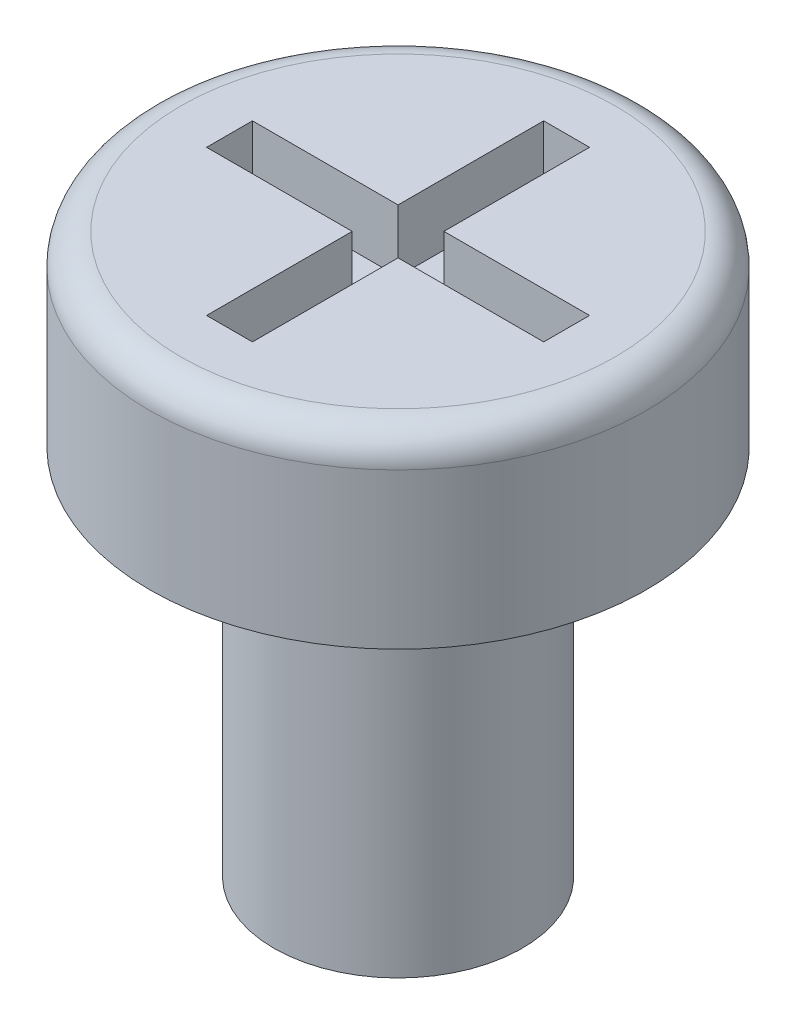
ISO-10303-21;
HEADER;
FILE_DESCRIPTION(('STEP AP214'),'2;1');
FILE_NAME('part.step','',(''),(''),'','','');
FILE_SCHEMA(('AUTOMOTIVE_DESIGN { 1 0 10303 214 1 1 1 1 }'));
ENDSEC;
DATA;
#1=APPLICATION_CONTEXT('core data for automotive mechanical design processes');
#2=APPLICATION_PROTOCOL_DEFINITION('international standard','automotive_design',2000,#1);
#3=PRODUCT_CONTEXT('',#1,'mechanical');
#4=PRODUCT('Part','Part','',(#3));
#5=PRODUCT_RELATED_PRODUCT_CATEGORY('part','',(#4));
#6=PRODUCT_DEFINITION_FORMATION('','',#4);
#7=PRODUCT_DEFINITION_CONTEXT('part definition',#1,'design');
#8=PRODUCT_DEFINITION('design','',#6,#7);
#9=PRODUCT_DEFINITION_SHAPE('','',#8);
#10=(LENGTH_UNIT() NAMED_UNIT(*) SI_UNIT(.MILLI.,.METRE.));
#11=(NAMED_UNIT(*) PLANE_ANGLE_UNIT() SI_UNIT($,.RADIAN.));
#12=(NAMED_UNIT(*) SI_UNIT($,.STERADIAN.) SOLID_ANGLE_UNIT());
#13=UNCERTAINTY_MEASURE_WITH_UNIT(LENGTH_MEASURE(1.E-05),#10,'distance_accuracy_value','');
#14=(GEOMETRIC_REPRESENTATION_CONTEXT(3) GLOBAL_UNCERTAINTY_ASSIGNED_CONTEXT((#13)) GLOBAL_UNIT_ASSIGNED_CONTEXT((#10,
#11,#12)) REPRESENTATION_CONTEXT('',''));
#15=CARTESIAN_POINT('',(0.,0.,0.));
#16=DIRECTION('',(0.,0.,1.));
#17=DIRECTION('',(1.,0.,0.));
#18=AXIS2_PLACEMENT_3D('',#15,#16,#17);
#19=CARTESIAN_POINT('',(0.,3.,0.));
#20=DIRECTION('',(0.,-1.,0.));
#21=DIRECTION('',(0.,0.,-1.));
#22=AXIS2_PLACEMENT_3D('',#19,#20,#21);
#23=CYLINDRICAL_SURFACE('',#22,0.999999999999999);
#24=CARTESIAN_POINT('',(0.,3.,0.));
#25=DIRECTION('',(0.,1.,0.));
#26=DIRECTION('',(0.,0.,1.));
#27=AXIS2_PLACEMENT_3D('',#24,#25,#26);
#28=CIRCLE('',#27,0.999999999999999);
#29=CARTESIAN_POINT('',(0.,3.,0.999999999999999));
#30=VERTEX_POINT('',#29);
#31=EDGE_CURVE('E209',#30,#30,#28,.T.);
#32=ORIENTED_EDGE('',*,*,#31,.F.);
#33=EDGE_LOOP('',(#32));
#34=FACE_BOUND('',#33,.T.);
#35=CARTESIAN_POINT('',(0.,0.,0.));
#36=DIRECTION('',(0.,1.,0.));
#37=DIRECTION('',(0.,0.,1.));
#38=AXIS2_PLACEMENT_3D('',#35,#36,#37);
#39=CIRCLE('',#38,0.999999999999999);
#40=CARTESIAN_POINT('',(0.,0.,0.999999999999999));
#41=VERTEX_POINT('',#40);
#42=EDGE_CURVE('E208',#41,#41,#39,.T.);
#43=ORIENTED_EDGE('',*,*,#42,.T.);
#44=EDGE_LOOP('',(#43));
#45=FACE_BOUND('',#44,.T.);
#46=ADVANCED_FACE('F32',(#34,#45),#23,.T.);
#47=CARTESIAN_POINT('',(0.,0.,0.));
#48=DIRECTION('',(0.,1.,0.));
#49=DIRECTION('',(0.,0.,1.));
#50=AXIS2_PLACEMENT_3D('',#47,#48,#49);
#51=PLANE('',#50);
#52=ORIENTED_EDGE('',*,*,#42,.F.);
#53=EDGE_LOOP('',(#52));
#54=FACE_BOUND('',#53,.T.);
#55=ADVANCED_FACE('F232',(#54),#51,.F.);
#56=CARTESIAN_POINT('',(0.,3.,0.));
#57=DIRECTION('',(0.,1.,0.));
#58=DIRECTION('',(0.,0.,1.));
#59=AXIS2_PLACEMENT_3D('',#56,#57,#58);
#60=PLANE('',#59);
#61=CARTESIAN_POINT('',(0.,3.,0.));
#62=DIRECTION('',(0.,1.,0.));
#63=DIRECTION('',(0.,0.,1.));
#64=AXIS2_PLACEMENT_3D('',#61,#62,#63);
#65=CIRCLE('',#64,2.);
#66=CARTESIAN_POINT('',(0.,3.,2.));
#67=VERTEX_POINT('',#66);
#68=EDGE_CURVE('E188',#67,#67,#65,.T.);
#69=ORIENTED_EDGE('',*,*,#68,.F.);
#70=EDGE_LOOP('',(#69));
#71=FACE_BOUND('',#70,.T.);
#72=ORIENTED_EDGE('',*,*,#31,.T.);
#73=EDGE_LOOP('',(#72));
#74=FACE_BOUND('',#73,.T.);
#75=ADVANCED_FACE('F237',(#71,#74),#60,.F.);
#76=CARTESIAN_POINT('',(0.,4.5,0.));
#77=DIRECTION('',(0.,-1.,0.));
#78=DIRECTION('',(0.,0.,-1.));
#79=AXIS2_PLACEMENT_3D('',#76,#77,#78);
#80=CYLINDRICAL_SURFACE('',#79,2.);
#81=CARTESIAN_POINT('',(0.,4.25,0.));
#82=DIRECTION('',(0.,1.,0.));
#83=DIRECTION('',(0.,0.,1.));
#84=AXIS2_PLACEMENT_3D('',#81,#82,#83);
#85=CIRCLE('',#84,2.);
#86=CARTESIAN_POINT('',(0.,4.25,2.));
#87=VERTEX_POINT('',#86);
#88=EDGE_CURVE('E11',#87,#87,#85,.F.);
#89=ORIENTED_EDGE('',*,*,#88,.T.);
#90=EDGE_LOOP('',(#89));
#91=FACE_BOUND('',#90,.T.);
#92=ORIENTED_EDGE('',*,*,#68,.T.);
#93=EDGE_LOOP('',(#92));
#94=FACE_BOUND('',#93,.T.);
#95=ADVANCED_FACE('F227',(#91,#94),#80,.T.);
#96=CARTESIAN_POINT('',(0.,4.5,0.));
#97=DIRECTION('',(0.,1.,0.));
#98=DIRECTION('',(0.,0.,1.));
#99=AXIS2_PLACEMENT_3D('',#96,#97,#98);
#100=PLANE('',#99);
#101=DIRECTION('',(0.,0.,-1.));
#102=VECTOR('',#101,1.);
#103=CARTESIAN_POINT('',(0.184631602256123,4.5,-0.184631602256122));
#104=LINE('',#103,#102);
#105=CARTESIAN_POINT('',(0.184631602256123,4.5,-0.184631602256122));
#106=VERTEX_POINT('',#105);
#107=CARTESIAN_POINT('',(0.184631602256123,4.5,-1.35729177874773));
#108=VERTEX_POINT('',#107);
#109=EDGE_CURVE('E47',#106,#108,#104,.T.);
#110=ORIENTED_EDGE('',*,*,#109,.F.);
#111=DIRECTION('',(-1.,0.,0.));
#112=VECTOR('',#111,1.);
#113=CARTESIAN_POINT('',(0.184631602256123,4.5,-0.184631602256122));
#114=LINE('',#113,#112);
#115=CARTESIAN_POINT('',(1.35729177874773,4.5,-0.184631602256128));
#116=VERTEX_POINT('',#115);
#117=EDGE_CURVE('E184',#116,#106,#114,.T.);
#118=ORIENTED_EDGE('',*,*,#117,.F.);
#119=DIRECTION('',(0.,0.,-1.));
#120=VECTOR('',#119,1.);
#121=CARTESIAN_POINT('',(1.35729177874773,4.5,0.184631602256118));
#122=LINE('',#121,#120);
#123=CARTESIAN_POINT('',(1.35729177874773,4.5,0.184631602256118));
#124=VERTEX_POINT('',#123);
#125=EDGE_CURVE('E182',#124,#116,#122,.T.);
#126=ORIENTED_EDGE('',*,*,#125,.F.);
#127=DIRECTION('',(1.,0.,0.));
#128=VECTOR('',#127,1.);
#129=CARTESIAN_POINT('',(0.184631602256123,4.5,0.184631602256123));
#130=LINE('',#129,#128);
#131=CARTESIAN_POINT('',(0.184631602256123,4.5,0.184631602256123));
#132=VERTEX_POINT('',#131);
#133=EDGE_CURVE('E131',#132,#124,#130,.T.);
#134=ORIENTED_EDGE('',*,*,#133,.F.);
#135=DIRECTION('',(0.,0.,-1.));
#136=VECTOR('',#135,1.);
#137=CARTESIAN_POINT('',(0.184631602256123,4.5,1.35729177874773));
#138=LINE('',#137,#136);
#139=CARTESIAN_POINT('',(0.184631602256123,4.5,1.35729177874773));
#140=VERTEX_POINT('',#139);
#141=EDGE_CURVE('E178',#140,#132,#138,.T.);
#142=ORIENTED_EDGE('',*,*,#141,.F.);
#143=DIRECTION('',(1.,0.,0.));
#144=VECTOR('',#143,1.);
#145=CARTESIAN_POINT('',(-0.184631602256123,4.5,1.35729177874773));
#146=LINE('',#145,#144);
#147=CARTESIAN_POINT('',(-0.184631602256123,4.5,1.35729177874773));
#148=VERTEX_POINT('',#147);
#149=EDGE_CURVE('E175',#148,#140,#146,.T.);
#150=ORIENTED_EDGE('',*,*,#149,.F.);
#151=DIRECTION('',(0.,0.,1.));
#152=VECTOR('',#151,1.);
#153=CARTESIAN_POINT('',(-0.184631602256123,4.5,1.35729177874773));
#154=LINE('',#153,#152);
#155=CARTESIAN_POINT('',(-0.184631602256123,4.5,0.184631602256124));
#156=VERTEX_POINT('',#155);
#157=EDGE_CURVE('E172',#156,#148,#154,.T.);
#158=ORIENTED_EDGE('',*,*,#157,.F.);
#159=DIRECTION('',(1.,0.,0.));
#160=VECTOR('',#159,1.);
#161=CARTESIAN_POINT('',(-1.35729177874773,4.5,0.184631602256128));
#162=LINE('',#161,#160);
#163=CARTESIAN_POINT('',(-1.35729177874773,4.5,0.184631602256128));
#164=VERTEX_POINT('',#163);
#165=EDGE_CURVE('E169',#164,#156,#162,.T.);
#166=ORIENTED_EDGE('',*,*,#165,.F.);
#167=DIRECTION('',(0.,0.,1.));
#168=VECTOR('',#167,1.);
#169=CARTESIAN_POINT('',(-1.35729177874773,4.5,0.184631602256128));
#170=LINE('',#169,#168);
#171=CARTESIAN_POINT('',(-1.35729177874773,4.5,-0.184631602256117));
#172=VERTEX_POINT('',#171);
#173=EDGE_CURVE('E166',#172,#164,#170,.T.);
#174=ORIENTED_EDGE('',*,*,#173,.F.);
#175=DIRECTION('',(-1.,0.,0.));
#176=VECTOR('',#175,1.);
#177=CARTESIAN_POINT('',(-1.35729177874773,4.5,-0.184631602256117));
#178=LINE('',#177,#176);
#179=CARTESIAN_POINT('',(-0.184631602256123,4.5,-0.184631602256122));
#180=VERTEX_POINT('',#179);
#181=EDGE_CURVE('E163',#180,#172,#178,.T.);
#182=ORIENTED_EDGE('',*,*,#181,.F.);
#183=DIRECTION('',(0.,0.,1.));
#184=VECTOR('',#183,1.);
#185=CARTESIAN_POINT('',(-0.184631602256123,4.5,-0.184631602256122));
#186=LINE('',#185,#184);
#187=CARTESIAN_POINT('',(-0.184631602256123,4.5,-1.35729177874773));
#188=VERTEX_POINT('',#187);
#189=EDGE_CURVE('E160',#188,#180,#186,.T.);
#190=ORIENTED_EDGE('',*,*,#189,.F.);
#191=DIRECTION('',(-1.,0.,0.));
#192=VECTOR('',#191,1.);
#193=CARTESIAN_POINT('',(-0.184631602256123,4.5,-1.35729177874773));
#194=LINE('',#193,#192);
#195=EDGE_CURVE('E157',#108,#188,#194,.T.);
#196=ORIENTED_EDGE('',*,*,#195,.F.);
#197=EDGE_LOOP('',(#110,#118,#126,#134,#142,#150,#158,#166,#174,#182,#190,#196));
#198=FACE_BOUND('',#197,.T.);
#199=CARTESIAN_POINT('',(0.,4.5,0.));
#200=DIRECTION('',(0.,1.,0.));
#201=DIRECTION('',(0.,0.,1.));
#202=AXIS2_PLACEMENT_3D('',#199,#200,#201);
#203=CIRCLE('',#202,1.75);
#204=CARTESIAN_POINT('',(0.,4.5,1.75));
#205=VERTEX_POINT('',#204);
#206=EDGE_CURVE('E40',#205,#205,#203,.T.);
#207=ORIENTED_EDGE('',*,*,#206,.T.);
#208=EDGE_LOOP('',(#207));
#209=FACE_BOUND('',#208,.T.);
#210=ADVANCED_FACE('F216',(#198,#209),#100,.T.);
#211=CARTESIAN_POINT('',(0.,4.25,0.));
#212=DIRECTION('',(0.,1.,0.));
#213=DIRECTION('',(0.,0.,1.));
#214=AXIS2_PLACEMENT_3D('',#211,#212,#213);
#215=TOROIDAL_SURFACE('',#214,1.75,0.25);
#216=ORIENTED_EDGE('',*,*,#88,.F.);
#217=EDGE_LOOP('',(#216));
#218=FACE_BOUND('',#217,.T.);
#219=ORIENTED_EDGE('',*,*,#206,.F.);
#220=EDGE_LOOP('',(#219));
#221=FACE_BOUND('',#220,.T.);
#222=ADVANCED_FACE('F34',(#218,#221),#215,.T.);
#223=CARTESIAN_POINT('',(0.184631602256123,4.,-0.184631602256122));
#224=DIRECTION('',(1.,0.,0.));
#225=DIRECTION('',(0.,0.,-1.));
#226=AXIS2_PLACEMENT_3D('',#223,#224,#225);
#227=PLANE('',#226);
#228=ORIENTED_EDGE('',*,*,#109,.T.);
#229=DIRECTION('',(0.,1.,0.));
#230=VECTOR('',#229,1.);
#231=CARTESIAN_POINT('',(0.184631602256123,4.,-1.35729177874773));
#232=LINE('',#231,#230);
#233=CARTESIAN_POINT('',(0.184631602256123,4.,-1.35729177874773));
#234=VERTEX_POINT('',#233);
#235=EDGE_CURVE('E95',#234,#108,#232,.T.);
#236=ORIENTED_EDGE('',*,*,#235,.F.);
#237=DIRECTION('',(0.,0.,-1.));
#238=VECTOR('',#237,1.);
#239=CARTESIAN_POINT('',(0.184631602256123,4.,-0.184631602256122));
#240=LINE('',#239,#238);
#241=CARTESIAN_POINT('',(0.184631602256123,4.,-0.184631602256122));
#242=VERTEX_POINT('',#241);
#243=EDGE_CURVE('E186',#242,#234,#240,.T.);
#244=ORIENTED_EDGE('',*,*,#243,.F.);
#245=DIRECTION('',(0.,1.,0.));
#246=VECTOR('',#245,1.);
#247=CARTESIAN_POINT('',(0.184631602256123,4.,-0.184631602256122));
#248=LINE('',#247,#246);
#249=EDGE_CURVE('E55',#242,#106,#248,.T.);
#250=ORIENTED_EDGE('',*,*,#249,.T.);
#251=EDGE_LOOP('',(#228,#236,#244,#250));
#252=FACE_BOUND('',#251,.T.);
#253=ADVANCED_FACE('F219',(#252),#227,.F.);
#254=CARTESIAN_POINT('',(0.184631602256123,4.,-0.184631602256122));
#255=DIRECTION('',(0.,0.,-1.));
#256=DIRECTION('',(-1.,0.,0.));
#257=AXIS2_PLACEMENT_3D('',#254,#255,#256);
#258=PLANE('',#257);
#259=ORIENTED_EDGE('',*,*,#117,.T.);
#260=ORIENTED_EDGE('',*,*,#249,.F.);
#261=DIRECTION('',(-1.,0.,0.));
#262=VECTOR('',#261,1.);
#263=CARTESIAN_POINT('',(0.184631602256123,4.,-0.184631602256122));
#264=LINE('',#263,#262);
#265=CARTESIAN_POINT('',(1.35729177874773,4.,-0.184631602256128));
#266=VERTEX_POINT('',#265);
#267=EDGE_CURVE('E143',#266,#242,#264,.T.);
#268=ORIENTED_EDGE('',*,*,#267,.F.);
#269=DIRECTION('',(0.,1.,0.));
#270=VECTOR('',#269,1.);
#271=CARTESIAN_POINT('',(1.35729177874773,4.,-0.184631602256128));
#272=LINE('',#271,#270);
#273=EDGE_CURVE('E135',#266,#116,#272,.T.);
#274=ORIENTED_EDGE('',*,*,#273,.T.);
#275=EDGE_LOOP('',(#259,#260,#268,#274));
#276=FACE_BOUND('',#275,.T.);
#277=ADVANCED_FACE('F225',(#276),#258,.F.);
#278=CARTESIAN_POINT('',(1.35729177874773,4.,0.184631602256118));
#279=DIRECTION('',(1.,0.,0.));
#280=DIRECTION('',(0.,0.,-1.));
#281=AXIS2_PLACEMENT_3D('',#278,#279,#280);
#282=PLANE('',#281);
#283=ORIENTED_EDGE('',*,*,#125,.T.);
#284=ORIENTED_EDGE('',*,*,#273,.F.);
#285=DIRECTION('',(0.,0.,-1.));
#286=VECTOR('',#285,1.);
#287=CARTESIAN_POINT('',(1.35729177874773,4.,0.184631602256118));
#288=LINE('',#287,#286);
#289=CARTESIAN_POINT('',(1.35729177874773,4.,0.184631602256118));
#290=VERTEX_POINT('',#289);
#291=EDGE_CURVE('E139',#290,#266,#288,.T.);
#292=ORIENTED_EDGE('',*,*,#291,.F.);
#293=DIRECTION('',(0.,1.,0.));
#294=VECTOR('',#293,1.);
#295=CARTESIAN_POINT('',(1.35729177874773,4.,0.184631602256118));
#296=LINE('',#295,#294);
#297=EDGE_CURVE('E124',#290,#124,#296,.T.);
#298=ORIENTED_EDGE('',*,*,#297,.T.);
#299=EDGE_LOOP('',(#283,#284,#292,#298));
#300=FACE_BOUND('',#299,.T.);
#301=ADVANCED_FACE('F140',(#300),#282,.F.);
#302=CARTESIAN_POINT('',(0.184631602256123,4.,0.184631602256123));
#303=DIRECTION('',(0.,0.,1.));
#304=DIRECTION('',(1.,0.,0.));
#305=AXIS2_PLACEMENT_3D('',#302,#303,#304);
#306=PLANE('',#305);
#307=ORIENTED_EDGE('',*,*,#133,.T.);
#308=ORIENTED_EDGE('',*,*,#297,.F.);
#309=DIRECTION('',(1.,0.,0.));
#310=VECTOR('',#309,1.);
#311=CARTESIAN_POINT('',(0.184631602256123,4.,0.184631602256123));
#312=LINE('',#311,#310);
#313=CARTESIAN_POINT('',(0.184631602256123,4.,0.184631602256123));
#314=VERTEX_POINT('',#313);
#315=EDGE_CURVE('E128',#314,#290,#312,.T.);
#316=ORIENTED_EDGE('',*,*,#315,.F.);
#317=DIRECTION('',(0.,1.,0.));
#318=VECTOR('',#317,1.);
#319=CARTESIAN_POINT('',(0.184631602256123,4.,0.184631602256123));
#320=LINE('',#319,#318);
#321=EDGE_CURVE('E136',#314,#132,#320,.T.);
#322=ORIENTED_EDGE('',*,*,#321,.T.);
#323=EDGE_LOOP('',(#307,#308,#316,#322));
#324=FACE_BOUND('',#323,.T.);
#325=ADVANCED_FACE('F126',(#324),#306,.F.);
#326=CARTESIAN_POINT('',(0.184631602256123,4.,1.35729177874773));
#327=DIRECTION('',(1.,0.,0.));
#328=DIRECTION('',(0.,0.,-1.));
#329=AXIS2_PLACEMENT_3D('',#326,#327,#328);
#330=PLANE('',#329);
#331=ORIENTED_EDGE('',*,*,#141,.T.);
#332=ORIENTED_EDGE('',*,*,#321,.F.);
#333=DIRECTION('',(0.,0.,-1.));
#334=VECTOR('',#333,1.);
#335=CARTESIAN_POINT('',(0.184631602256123,4.,1.35729177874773));
#336=LINE('',#335,#334);
#337=CARTESIAN_POINT('',(0.184631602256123,4.,1.35729177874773));
#338=VERTEX_POINT('',#337);
#339=EDGE_CURVE('E149',#338,#314,#336,.T.);
#340=ORIENTED_EDGE('',*,*,#339,.F.);
#341=DIRECTION('',(0.,1.,0.));
#342=VECTOR('',#341,1.);
#343=CARTESIAN_POINT('',(0.184631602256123,4.,1.35729177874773));
#344=LINE('',#343,#342);
#345=EDGE_CURVE('E191',#338,#140,#344,.T.);
#346=ORIENTED_EDGE('',*,*,#345,.T.);
#347=EDGE_LOOP('',(#331,#332,#340,#346));
#348=FACE_BOUND('',#347,.T.);
#349=ADVANCED_FACE('F276',(#348),#330,.F.);
#350=CARTESIAN_POINT('',(-0.184631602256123,4.,1.35729177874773));
#351=DIRECTION('',(0.,0.,1.));
#352=DIRECTION('',(1.,0.,0.));
#353=AXIS2_PLACEMENT_3D('',#350,#351,#352);
#354=PLANE('',#353);
#355=ORIENTED_EDGE('',*,*,#149,.T.);
#356=ORIENTED_EDGE('',*,*,#345,.F.);
#357=DIRECTION('',(1.,0.,0.));
#358=VECTOR('',#357,1.);
#359=CARTESIAN_POINT('',(-0.184631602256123,4.,1.35729177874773));
#360=LINE('',#359,#358);
#361=CARTESIAN_POINT('',(-0.184631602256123,4.,1.35729177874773));
#362=VERTEX_POINT('',#361);
#363=EDGE_CURVE('E151',#362,#338,#360,.T.);
#364=ORIENTED_EDGE('',*,*,#363,.F.);
#365=DIRECTION('',(0.,1.,0.));
#366=VECTOR('',#365,1.);
#367=CARTESIAN_POINT('',(-0.184631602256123,4.,1.35729177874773));
#368=LINE('',#367,#366);
#369=EDGE_CURVE('E193',#362,#148,#368,.T.);
#370=ORIENTED_EDGE('',*,*,#369,.T.);
#371=EDGE_LOOP('',(#355,#356,#364,#370));
#372=FACE_BOUND('',#371,.T.);
#373=ADVANCED_FACE('F272',(#372),#354,.F.);
#374=CARTESIAN_POINT('',(-0.184631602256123,4.,1.35729177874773));
#375=DIRECTION('',(-1.,0.,0.));
#376=DIRECTION('',(0.,0.,1.));
#377=AXIS2_PLACEMENT_3D('',#374,#375,#376);
#378=PLANE('',#377);
#379=ORIENTED_EDGE('',*,*,#157,.T.);
#380=ORIENTED_EDGE('',*,*,#369,.F.);
#381=DIRECTION('',(0.,0.,1.));
#382=VECTOR('',#381,1.);
#383=CARTESIAN_POINT('',(-0.184631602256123,4.,1.35729177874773));
#384=LINE('',#383,#382);
#385=CARTESIAN_POINT('',(-0.184631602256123,4.,0.184631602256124));
#386=VERTEX_POINT('',#385);
#387=EDGE_CURVE('E420',#386,#362,#384,.T.);
#388=ORIENTED_EDGE('',*,*,#387,.F.);
#389=DIRECTION('',(0.,1.,0.));
#390=VECTOR('',#389,1.);
#391=CARTESIAN_POINT('',(-0.184631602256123,4.,0.184631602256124));
#392=LINE('',#391,#390);
#393=EDGE_CURVE('E195',#386,#156,#392,.T.);
#394=ORIENTED_EDGE('',*,*,#393,.T.);
#395=EDGE_LOOP('',(#379,#380,#388,#394));
#396=FACE_BOUND('',#395,.T.);
#397=ADVANCED_FACE('F268',(#396),#378,.F.);
#398=CARTESIAN_POINT('',(-1.35729177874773,4.,0.184631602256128));
#399=DIRECTION('',(0.,0.,1.));
#400=DIRECTION('',(1.,0.,0.));
#401=AXIS2_PLACEMENT_3D('',#398,#399,#400);
#402=PLANE('',#401);
#403=ORIENTED_EDGE('',*,*,#165,.T.);
#404=ORIENTED_EDGE('',*,*,#393,.F.);
#405=DIRECTION('',(1.,0.,0.));
#406=VECTOR('',#405,1.);
#407=CARTESIAN_POINT('',(-1.35729177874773,4.,0.184631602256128));
#408=LINE('',#407,#406);
#409=CARTESIAN_POINT('',(-1.35729177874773,4.,0.184631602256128));
#410=VERTEX_POINT('',#409);
#411=EDGE_CURVE('E417',#410,#386,#408,.T.);
#412=ORIENTED_EDGE('',*,*,#411,.F.);
#413=DIRECTION('',(0.,1.,0.));
#414=VECTOR('',#413,1.);
#415=CARTESIAN_POINT('',(-1.35729177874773,4.,0.184631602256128));
#416=LINE('',#415,#414);
#417=EDGE_CURVE('E197',#410,#164,#416,.T.);
#418=ORIENTED_EDGE('',*,*,#417,.T.);
#419=EDGE_LOOP('',(#403,#404,#412,#418));
#420=FACE_BOUND('',#419,.T.);
#421=ADVANCED_FACE('F264',(#420),#402,.F.);
#422=CARTESIAN_POINT('',(-1.35729177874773,4.,0.184631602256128));
#423=DIRECTION('',(-1.,0.,0.));
#424=DIRECTION('',(0.,0.,1.));
#425=AXIS2_PLACEMENT_3D('',#422,#423,#424);
#426=PLANE('',#425);
#427=ORIENTED_EDGE('',*,*,#173,.T.);
#428=ORIENTED_EDGE('',*,*,#417,.F.);
#429=DIRECTION('',(0.,0.,1.));
#430=VECTOR('',#429,1.);
#431=CARTESIAN_POINT('',(-1.35729177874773,4.,0.184631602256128));
#432=LINE('',#431,#430);
#433=CARTESIAN_POINT('',(-1.35729177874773,4.,-0.184631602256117));
#434=VERTEX_POINT('',#433);
#435=EDGE_CURVE('E414',#434,#410,#432,.T.);
#436=ORIENTED_EDGE('',*,*,#435,.F.);
#437=DIRECTION('',(0.,1.,0.));
#438=VECTOR('',#437,1.);
#439=CARTESIAN_POINT('',(-1.35729177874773,4.,-0.184631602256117));
#440=LINE('',#439,#438);
#441=EDGE_CURVE('E199',#434,#172,#440,.T.);
#442=ORIENTED_EDGE('',*,*,#441,.T.);
#443=EDGE_LOOP('',(#427,#428,#436,#442));
#444=FACE_BOUND('',#443,.T.);
#445=ADVANCED_FACE('F260',(#444),#426,.F.);
#446=CARTESIAN_POINT('',(-1.35729177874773,4.,-0.184631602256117));
#447=DIRECTION('',(0.,0.,-1.));
#448=DIRECTION('',(-1.,0.,0.));
#449=AXIS2_PLACEMENT_3D('',#446,#447,#448);
#450=PLANE('',#449);
#451=ORIENTED_EDGE('',*,*,#181,.T.);
#452=ORIENTED_EDGE('',*,*,#441,.F.);
#453=DIRECTION('',(-1.,0.,0.));
#454=VECTOR('',#453,1.);
#455=CARTESIAN_POINT('',(-1.35729177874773,4.,-0.184631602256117));
#456=LINE('',#455,#454);
#457=CARTESIAN_POINT('',(-0.184631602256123,4.,-0.184631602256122));
#458=VERTEX_POINT('',#457);
#459=EDGE_CURVE('E411',#458,#434,#456,.T.);
#460=ORIENTED_EDGE('',*,*,#459,.F.);
#461=DIRECTION('',(0.,1.,0.));
#462=VECTOR('',#461,1.);
#463=CARTESIAN_POINT('',(-0.184631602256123,4.,-0.184631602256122));
#464=LINE('',#463,#462);
#465=EDGE_CURVE('E201',#458,#180,#464,.T.);
#466=ORIENTED_EDGE('',*,*,#465,.T.);
#467=EDGE_LOOP('',(#451,#452,#460,#466));
#468=FACE_BOUND('',#467,.T.);
#469=ADVANCED_FACE('F256',(#468),#450,.F.);
#470=CARTESIAN_POINT('',(-0.184631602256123,4.,-0.184631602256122));
#471=DIRECTION('',(-1.,0.,0.));
#472=DIRECTION('',(0.,0.,1.));
#473=AXIS2_PLACEMENT_3D('',#470,#471,#472);
#474=PLANE('',#473);
#475=ORIENTED_EDGE('',*,*,#189,.T.);
#476=ORIENTED_EDGE('',*,*,#465,.F.);
#477=DIRECTION('',(0.,0.,1.));
#478=VECTOR('',#477,1.);
#479=CARTESIAN_POINT('',(-0.184631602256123,4.,-0.184631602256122));
#480=LINE('',#479,#478);
#481=CARTESIAN_POINT('',(-0.184631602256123,4.,-1.35729177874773));
#482=VERTEX_POINT('',#481);
#483=EDGE_CURVE('E406',#482,#458,#480,.T.);
#484=ORIENTED_EDGE('',*,*,#483,.F.);
#485=DIRECTION('',(0.,1.,0.));
#486=VECTOR('',#485,1.);
#487=CARTESIAN_POINT('',(-0.184631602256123,4.,-1.35729177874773));
#488=LINE('',#487,#486);
#489=EDGE_CURVE('E203',#482,#188,#488,.T.);
#490=ORIENTED_EDGE('',*,*,#489,.T.);
#491=EDGE_LOOP('',(#475,#476,#484,#490));
#492=FACE_BOUND('',#491,.T.);
#493=ADVANCED_FACE('F252',(#492),#474,.F.);
#494=CARTESIAN_POINT('',(-0.184631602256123,4.,-1.35729177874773));
#495=DIRECTION('',(0.,0.,-1.));
#496=DIRECTION('',(-1.,0.,0.));
#497=AXIS2_PLACEMENT_3D('',#494,#495,#496);
#498=PLANE('',#497);
#499=ORIENTED_EDGE('',*,*,#195,.T.);
#500=ORIENTED_EDGE('',*,*,#489,.F.);
#501=DIRECTION('',(-1.,0.,0.));
#502=VECTOR('',#501,1.);
#503=CARTESIAN_POINT('',(-0.184631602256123,4.,-1.35729177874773));
#504=LINE('',#503,#502);
#505=EDGE_CURVE('E404',#234,#482,#504,.T.);
#506=ORIENTED_EDGE('',*,*,#505,.F.);
#507=ORIENTED_EDGE('',*,*,#235,.T.);
#508=EDGE_LOOP('',(#499,#500,#506,#507));
#509=FACE_BOUND('',#508,.T.);
#510=ADVANCED_FACE('F249',(#509),#498,.F.);
#511=CARTESIAN_POINT('',(0.,4.,0.));
#512=DIRECTION('',(0.,-1.,0.));
#513=DIRECTION('',(0.,0.,-1.));
#514=AXIS2_PLACEMENT_3D('',#511,#512,#513);
#515=PLANE('',#514);
#516=ORIENTED_EDGE('',*,*,#243,.T.);
#517=ORIENTED_EDGE('',*,*,#505,.T.);
#518=ORIENTED_EDGE('',*,*,#483,.T.);
#519=ORIENTED_EDGE('',*,*,#459,.T.);
#520=ORIENTED_EDGE('',*,*,#435,.T.);
#521=ORIENTED_EDGE('',*,*,#411,.T.);
#522=ORIENTED_EDGE('',*,*,#387,.T.);
#523=ORIENTED_EDGE('',*,*,#363,.T.);
#524=ORIENTED_EDGE('',*,*,#339,.T.);
#525=ORIENTED_EDGE('',*,*,#315,.T.);
#526=ORIENTED_EDGE('',*,*,#291,.T.);
#527=ORIENTED_EDGE('',*,*,#267,.T.);
#528=EDGE_LOOP('',(#516,#517,#518,#519,#520,#521,#522,#523,#524,#525,#526,#527));
#529=FACE_BOUND('',#528,.T.);
#530=ADVANCED_FACE('F146',(#529),#515,.F.);
#531=CLOSED_SHELL('',(#46,#55,#75,#95,#210,#222,#253,#277,#301,#325,#349,#373,#397,#421,#445,
#469,#493,#510,#530));
#532=MANIFOLD_SOLID_BREP('B2',#531);
#533=ADVANCED_BREP_SHAPE_REPRESENTATION('',(#18,#532),#14);
#534=SHAPE_DEFINITION_REPRESENTATION(#9,#533);
ENDSEC;
END-ISO-10303-21;
